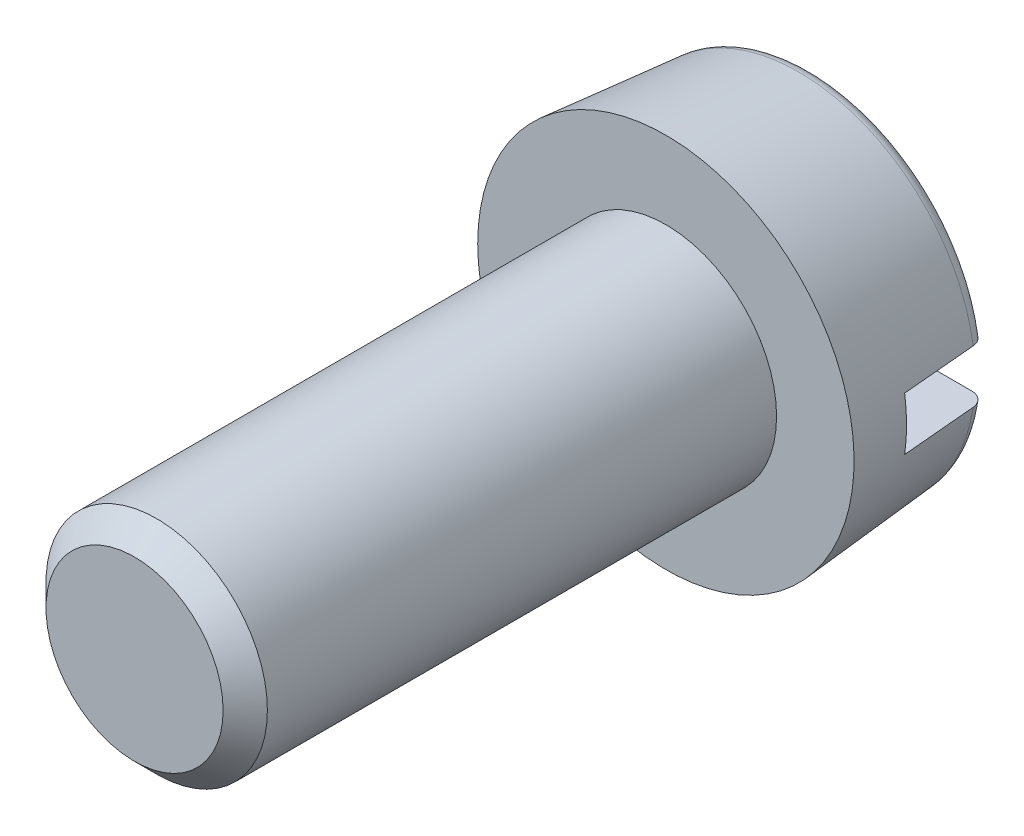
from build123d import *

# Parameters (mm, degrees)
ESQUISSE2_W             = 8.5
ESQUISSE2_H             = 1.2
ENLEV_MAT_EXTRU_1_DEPTH = 2
ESQUISSE3_W             = 2.5
ESQUISSE3_H             = 12
CHANFREIN1_SIZE         = 0.5


with BuildPart() as part:
    # Esquisse1 → Base-R_volution (revolve)
    with BuildSketch(Plane(origin=(0, 0, 0), x_dir=(1, 0, 0), z_dir=(0, 1, 0)), mode=Mode.PRIVATE) as base_r_volution_sk:
        with BuildLine():
            Line((0, 0), (4.25, 0))
            Line((4.25, 0), (3.987642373, 2.998761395))
            ThreePointArc((3.987642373, 2.998761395), (3.881842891, 3.213301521), (3.658898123, 3.3))
            Line((3.658898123, 3.3), (0, 3.3))
            Line((0, 3.3), (0, 0))
        make_face()
    revolve(base_r_volution_sk.sketch.rotate(Axis((0, 0, 0), (0, 0, -1)), 180), axis=Axis((0, 0, 0), (0, 0, -1)))

    # Esquisse2 → Enlev. mat.-Extru.1 (cut)
    with BuildSketch(Plane.XY.offset(-3.3)):
        Rectangle(ESQUISSE2_W, ESQUISSE2_H)
    extrude(amount=ENLEV_MAT_EXTRU_1_DEPTH, mode=Mode.SUBTRACT)

    # Esquisse3 → Boss.-R_vol.1 (revolve)
    with BuildSketch(Plane(origin=(0, 0, 0), x_dir=(1, 0, 0), z_dir=(0, 1, 0)), mode=Mode.PRIVATE) as boss_r_vol_1_sk:
        with Locations((1.25, -6)):
            Rectangle(ESQUISSE3_W, ESQUISSE3_H)
    revolve(boss_r_vol_1_sk.sketch.rotate(Axis((0, 0, 0), (0, 0, 1)), 351.659338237), axis=Axis((0, 0, 0), (0, 0, 1)))

    # Chanfrein1
    chanfrein1_edges = [part.edges().sort_by_distance(p)[0] for p in [
        (-2.473557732, 0.362646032, 12),
    ]]
    chamfer(chanfrein1_edges, length=CHANFREIN1_SIZE)


solid = part.part
